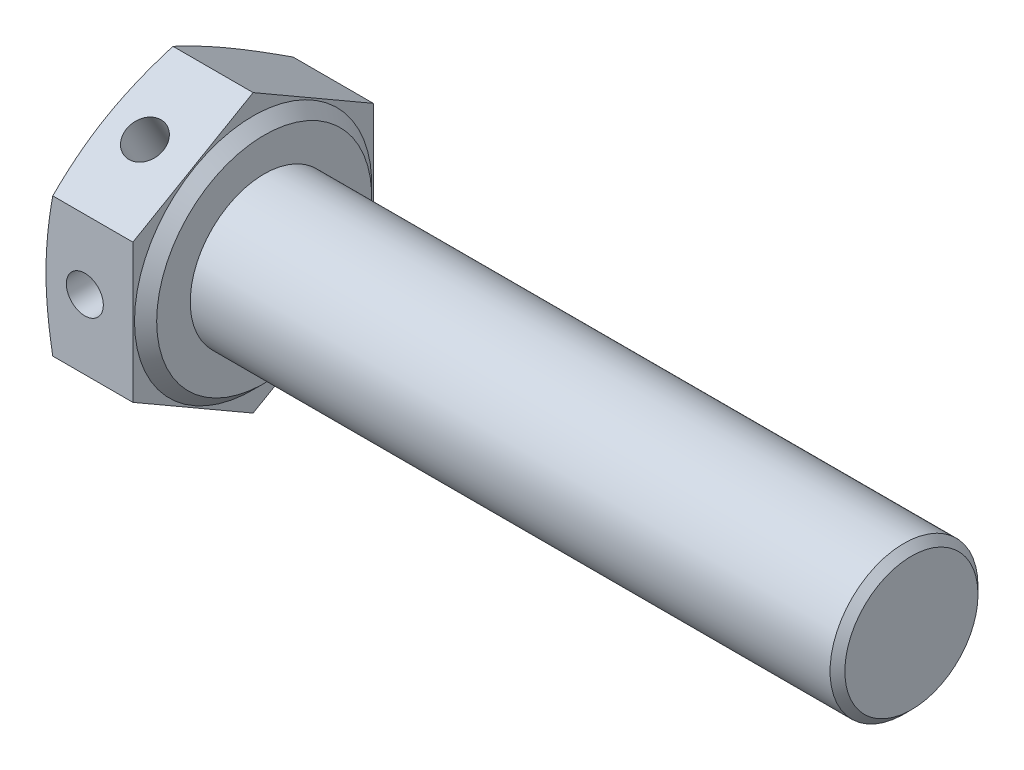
from build123d import *

# Parameters (mm, degrees)
BASEHEAD_DEPTH    = 5.3
SKETCH5_R         = 4
BASEBODY_DEPTH    = 35
CHAMFER1_SIZE     = 0.4
SKETCH6_R         = 1
HOLE_DEPTH        = 42.505100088
CIRPATTERN1_COUNT = 2
CIRPATTERN1_ANGLE = 60


with BuildPart() as part:
    # Sketch2 → BaseHead (new body)
    with BuildSketch(Plane(origin=(0, 0, 0), x_dir=(0, 0, -1), z_dir=(1, 0, 0))):
        Polygon((0, -7.505553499), (6.5, -3.75277675), (6.5, 3.75277675), (0, 7.505553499), (-6.5, 3.75277675), (-6.5, -3.75277675), align=None)
    extrude(amount=BASEHEAD_DEPTH)

    # Sketch3 → BearingFace (revolve, cut)
    with BuildSketch(Plane.XY, mode=Mode.PRIVATE) as bearingface_sk:
        Polygon((5.3, 7.505553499), (5.3, 5.815), (4.7, 6.415), (4.7, 7.505553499), align=None)
    revolve(bearingface_sk.sketch.rotate(Axis((-0.957090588, 0, 0), (1, 0, 0)), 90), axis=Axis((-0.957090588, 0, 0), (1, 0, 0)), mode=Mode.SUBTRACT)

    # Sketch4 → HeadChamfer (revolve, cut)
    with BuildSketch(Plane.XY):
        Polygon((0, 7.505553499), (0.365991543, 7.505553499), (0, 6.5), align=None)
    revolve(axis=Axis((-0.493528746, 0, 0), (1, 0, 0)), mode=Mode.SUBTRACT)

    # Sketch5 → BaseBody (add)
    with BuildSketch(Plane(origin=(5.3, 0, 0), x_dir=(0, 0, -1), z_dir=(1, 0, 0))):
        Circle(SKETCH5_R)
    extrude(amount=BASEBODY_DEPTH)

    # Chamfer1
    chamfer1_edges = [part.edges().sort_by_distance(p)[0] for p in [
        (40.3, 0, 4),
    ]]
    chamfer(chamfer1_edges, length=CHAMFER1_SIZE)

    # Sketch6 → Hole (cut, symmetric)
    with BuildSketch(Plane.XY):
        with Locations((2.1, 0)):
            Circle(SKETCH6_R)
    hole = extrude(amount=HOLE_DEPTH, both=True, mode=Mode.SUBTRACT)

    # CirPattern1: Hole ×2 about axis
    cirpattern1_axis = Axis((40.3, 0, 0), (-1, 0, 0))
    for i in range(1, CIRPATTERN1_COUNT):
        add(hole.rotate(cirpattern1_axis, i * CIRPATTERN1_ANGLE / (CIRPATTERN1_COUNT - 1)), mode=Mode.SUBTRACT)


solid = part.part
